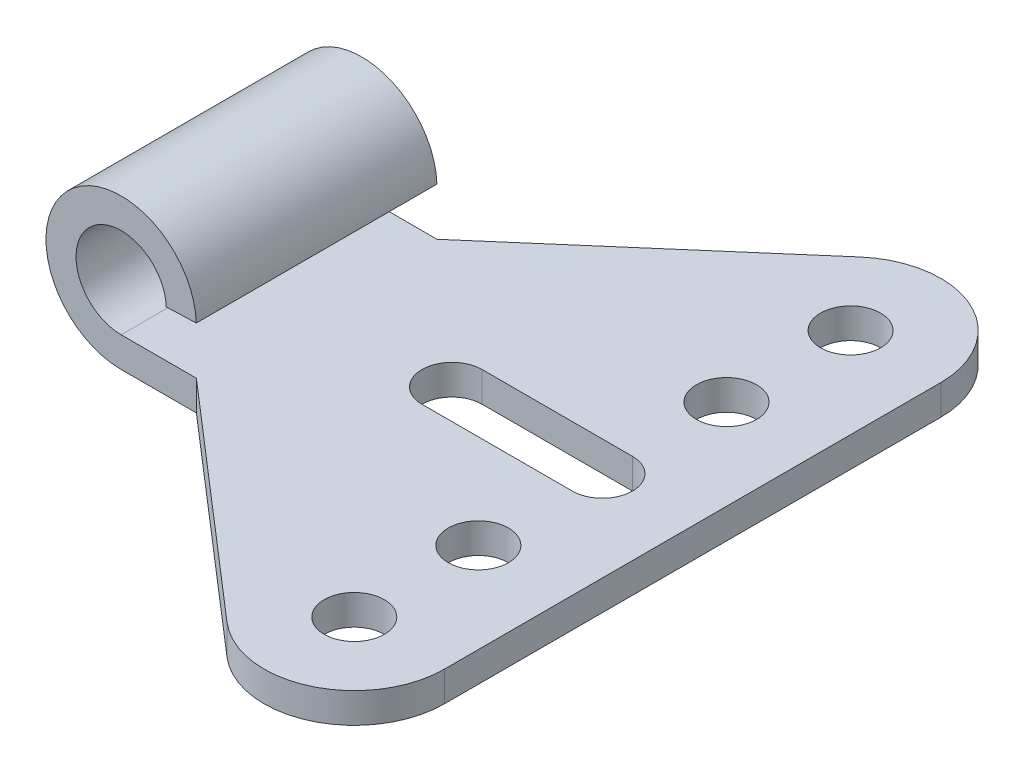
from build123d import *

# Parameters (mm, degrees)
BASE_EXTRUDE_THIN_DEPTH = 8
BOSS_EXTRUDE1_DEPTH     = 2
SKETCH3_R               = 2
CUT_EXTRUDE1_DEPTH      = 39.34383914


with BuildPart() as part:
    # Sketch1 → Base-Extrude-Thin (new, symmetric)
    with BuildSketch(Plane.XY):
        with BuildLine():
            ThreePointArc((4.996954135, 0.174497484), (-3.596699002, 3.473291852), (0, -5))
            Line((0, -5), (5, -5))
            Line((5, -5), (5, -3))
            Line((5, -3), (0, -3))
            ThreePointArc((0, -3), (-2.158019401, 2.083975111), (2.998172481, 0.10469849))
            Line((2.998172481, 0.10469849), (4.996954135, 0.174497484))
        make_face()
    extrude(amount=BASE_EXTRUDE_THIN_DEPTH, both=True)

    # Sketch2 → Boss-Extrude1 (add)
    with BuildSketch(Plane(origin=(0, -3, 0), x_dir=(-1, 0, 0), z_dir=(0, 1, 0))):
        with BuildLine():
            Line((-5, -8), (-5, 8))
            Line((-5, 8), (-20.075042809, 21.038139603))
            ThreePointArc((-20.075042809, 21.038139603), (-26.495020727, 21.956635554), (-30, 16.5))
            Line((-30, 16.5), (-30, -16.5))
            ThreePointArc((-30, -16.5), (-26.495020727, -21.956635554), (-20.075042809, -21.038139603))
            Line((-20.075042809, -21.038139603), (-5, -8))
        make_face()
    extrude(amount=-BOSS_EXTRUDE1_DEPTH)

    # Sketch3 → Cut-Extrude1 (cut, through all)
    with BuildSketch(Plane(origin=(0, -3, 0), x_dir=(-1, 0, 0), z_dir=(0, 1, 0))):
        with Locations(Location((-24, 16.5, 0), (0, 0, 90))):
            Circle(SKETCH3_R)
        with Locations(Location((-24, 8.25, 0), (0, 0, 90))):
            Circle(SKETCH3_R)
        with Locations(Location((-24, -16.5, 0), (0, 0, 270))):
            Circle(SKETCH3_R)
        with Locations(Location((-24, -8.25, 0), (0, 0, 270))):
            Circle(SKETCH3_R)
        with BuildLine():
            Line((-24, -2), (-14, -2))
            ThreePointArc((-14, -2), (-12, 0), (-14, 2))
            Line((-14, 2), (-24, 2))
            ThreePointArc((-24, 2), (-26, 0), (-24, -2))
        make_face()
    extrude(amount=-CUT_EXTRUDE1_DEPTH, mode=Mode.SUBTRACT)


solid = part.part
